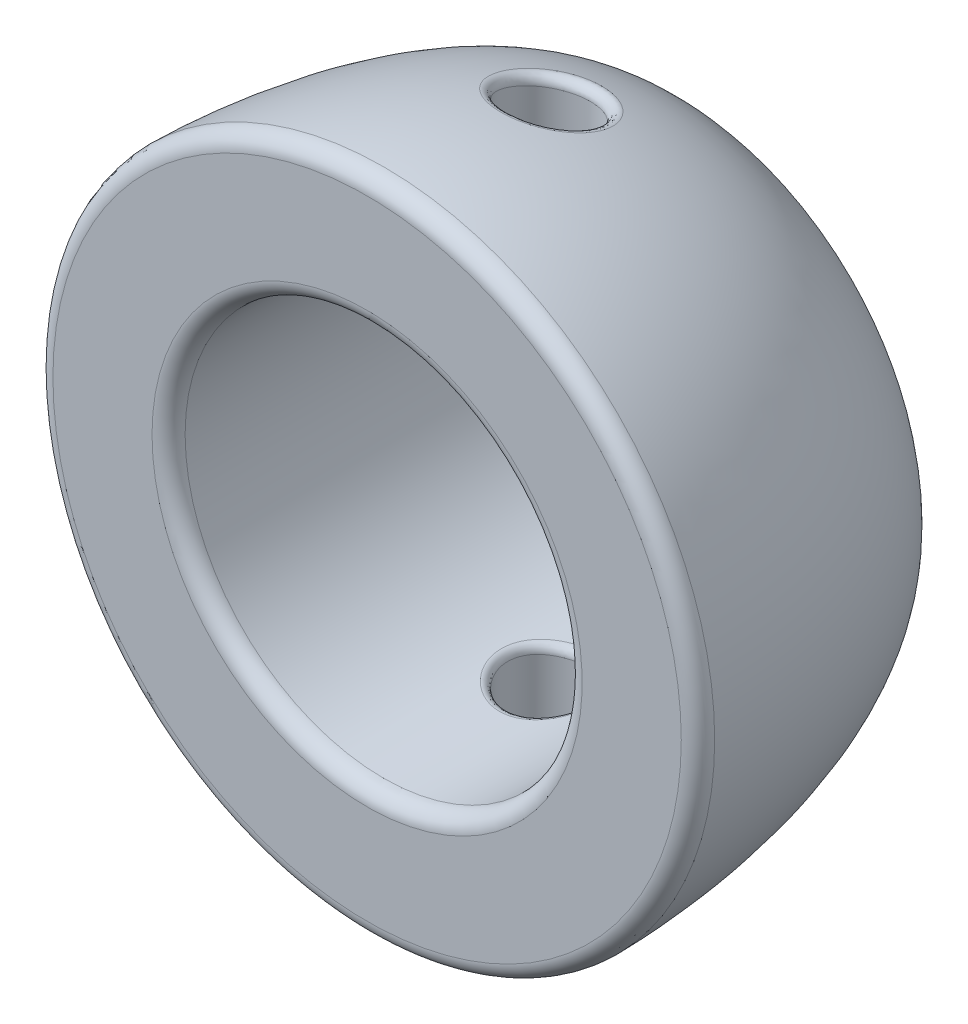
from build123d import *

# Parameters (mm, degrees)
FILLET_1_R          = 0.5
SKETCH_2_R          = 1.25
CUT_EXTRUDE_1_DEPTH = 10
FILLET_2_R          = 0.25


with BuildPart() as part:
    # Sketch 1 → Revolve 1 (revolve)
    with BuildSketch(Plane(origin=(0, 0, 0), x_dir=(0, 0, -1), z_dir=(1, 0, 0)), mode=Mode.PRIVATE) as revolve_1_sk:
        with BuildLine():
            Line((-5, 6), (5, 6))
            add(Edge.make_bspline(
                [(5, 6), (5, 10), (-5, 10)],
                knots=[0, 0, 0, 1.570796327, 1.570796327, 1.570796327], degree=2, weights=[1, 0.707106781, 1]))
            Line((-5, 10), (-5, 6))
        make_face()
    revolve(revolve_1_sk.sketch.rotate(Axis((0, 0, 5), (0, 0, -1)), 90), axis=Axis((0, 0, 5), (0, 0, -1)))

    # Fillet 1
    fillet_1_edges = [part.edges().sort_by_distance(p)[0] for p in [
        (-10, 0, 5),
        (-6, 0, -5),
        (-6, 0, 5),
    ]]
    fillet(fillet_1_edges, radius=FILLET_1_R)

    # Sketch 2 → Cut-Extrude 1 (cut, symmetric)
    with BuildSketch(Plane(origin=(0, 0, 0), x_dir=(1, 0, 0), z_dir=(0, 1, 0))):
        with Locations(Location((0, 0.5, 0), (0, 0, 270))):
            Circle(SKETCH_2_R)
    extrude(amount=CUT_EXTRUDE_1_DEPTH, both=True, mode=Mode.SUBTRACT)

    # Fillet 2
    fillet_2_edges = [part.edges().sort_by_distance(p)[0] for p in [
        (-1e-09, -8.951270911, -1.749999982),
        (1e-09, -6.000000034, -1.750000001),
        (-1e-09, 8.951270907, -1.749999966),
        (1e-09, 6.000000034, -1.750000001),
    ]]
    fillet(fillet_2_edges, radius=FILLET_2_R)


solid = part.part
